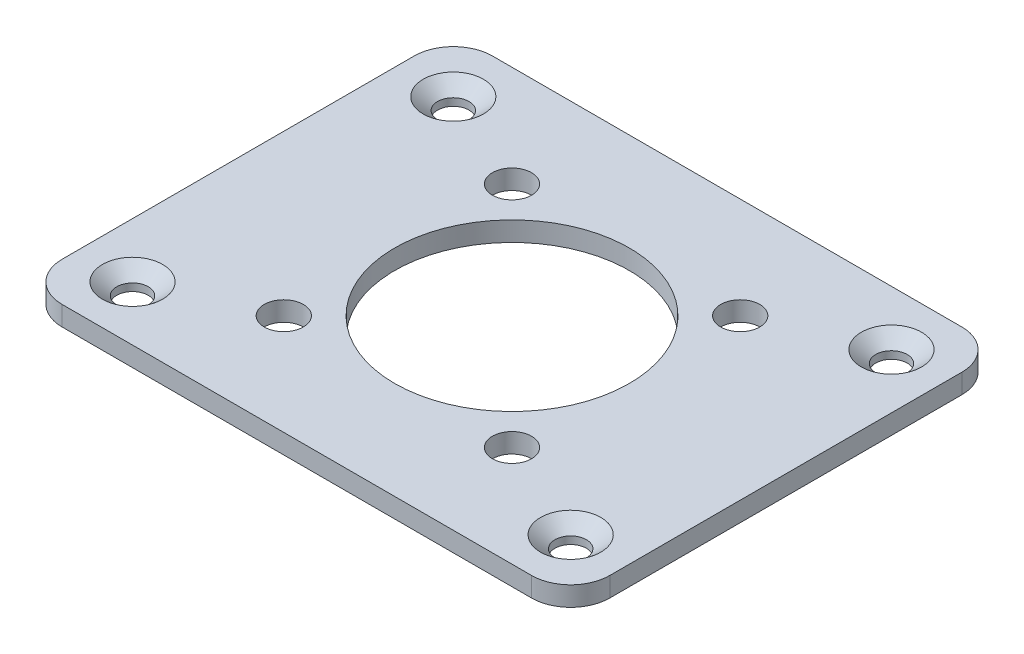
ISO-10303-21;
HEADER;
FILE_DESCRIPTION(('STEP AP214'),'2;1');
FILE_NAME('part.step','',(''),(''),'','','');
FILE_SCHEMA(('AUTOMOTIVE_DESIGN { 1 0 10303 214 1 1 1 1 }'));
ENDSEC;
DATA;
#1=APPLICATION_CONTEXT('core data for automotive mechanical design processes');
#2=APPLICATION_PROTOCOL_DEFINITION('international standard','automotive_design',2000,#1);
#3=PRODUCT_CONTEXT('',#1,'mechanical');
#4=PRODUCT('Part','Part','',(#3));
#5=PRODUCT_RELATED_PRODUCT_CATEGORY('part','',(#4));
#6=PRODUCT_DEFINITION_FORMATION('','',#4);
#7=PRODUCT_DEFINITION_CONTEXT('part definition',#1,'design');
#8=PRODUCT_DEFINITION('design','',#6,#7);
#9=PRODUCT_DEFINITION_SHAPE('','',#8);
#10=(LENGTH_UNIT() NAMED_UNIT(*) SI_UNIT(.MILLI.,.METRE.));
#11=(NAMED_UNIT(*) PLANE_ANGLE_UNIT() SI_UNIT($,.RADIAN.));
#12=(NAMED_UNIT(*) SI_UNIT($,.STERADIAN.) SOLID_ANGLE_UNIT());
#13=UNCERTAINTY_MEASURE_WITH_UNIT(LENGTH_MEASURE(1.E-05),#10,'distance_accuracy_value','');
#14=(GEOMETRIC_REPRESENTATION_CONTEXT(3) GLOBAL_UNCERTAINTY_ASSIGNED_CONTEXT((#13)) GLOBAL_UNIT_ASSIGNED_CONTEXT((#10,
#11,#12)) REPRESENTATION_CONTEXT('',''));
#15=CARTESIAN_POINT('',(0.,0.,0.));
#16=DIRECTION('',(0.,0.,1.));
#17=DIRECTION('',(1.,0.,0.));
#18=AXIS2_PLACEMENT_3D('',#15,#16,#17);
#19=CARTESIAN_POINT('',(0.,3.17499999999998,0.));
#20=DIRECTION('',(0.,1.,0.));
#21=DIRECTION('',(0.,0.,1.));
#22=AXIS2_PLACEMENT_3D('',#19,#20,#21);
#23=PLANE('',#22);
#24=CARTESIAN_POINT('',(-35.5600000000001,3.17500000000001,-26.0350000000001));
#25=DIRECTION('',(0.,1.,0.));
#26=DIRECTION('',(0.,0.,1.));
#27=AXIS2_PLACEMENT_3D('',#24,#25,#26);
#28=CIRCLE('',#27,4.8895);
#29=CARTESIAN_POINT('',(-35.5600000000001,3.17500000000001,-21.1455000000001));
#30=VERTEX_POINT('',#29);
#31=EDGE_CURVE('E259',#30,#30,#28,.T.);
#32=ORIENTED_EDGE('',*,*,#31,.F.);
#33=EDGE_LOOP('',(#32));
#34=FACE_BOUND('',#33,.T.);
#35=CARTESIAN_POINT('',(35.5600000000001,3.17500000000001,-26.0350000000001));
#36=DIRECTION('',(0.,1.,0.));
#37=DIRECTION('',(0.,0.,1.));
#38=AXIS2_PLACEMENT_3D('',#35,#36,#37);
#39=CIRCLE('',#38,4.8895);
#40=CARTESIAN_POINT('',(35.5600000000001,3.17500000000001,-21.1455000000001));
#41=VERTEX_POINT('',#40);
#42=EDGE_CURVE('E250',#41,#41,#39,.T.);
#43=ORIENTED_EDGE('',*,*,#42,.F.);
#44=EDGE_LOOP('',(#43));
#45=FACE_BOUND('',#44,.T.);
#46=CARTESIAN_POINT('',(-35.5600000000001,3.17499999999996,26.0350000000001));
#47=DIRECTION('',(0.,1.,0.));
#48=DIRECTION('',(0.,0.,1.));
#49=AXIS2_PLACEMENT_3D('',#46,#47,#48);
#50=CIRCLE('',#49,4.8895);
#51=CARTESIAN_POINT('',(-35.5600000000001,3.17499999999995,30.9245000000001));
#52=VERTEX_POINT('',#51);
#53=EDGE_CURVE('E241',#52,#52,#50,.T.);
#54=ORIENTED_EDGE('',*,*,#53,.F.);
#55=EDGE_LOOP('',(#54));
#56=FACE_BOUND('',#55,.T.);
#57=CARTESIAN_POINT('',(35.5600000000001,3.17499999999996,26.0350000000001));
#58=DIRECTION('',(0.,1.,0.));
#59=DIRECTION('',(0.,0.,1.));
#60=AXIS2_PLACEMENT_3D('',#57,#58,#59);
#61=CIRCLE('',#60,4.8895);
#62=CARTESIAN_POINT('',(35.5600000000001,3.17499999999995,30.9245000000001));
#63=VERTEX_POINT('',#62);
#64=EDGE_CURVE('E232',#63,#63,#61,.T.);
#65=ORIENTED_EDGE('',*,*,#64,.F.);
#66=EDGE_LOOP('',(#65));
#67=FACE_BOUND('',#66,.T.);
#68=CARTESIAN_POINT('',(-18.5217782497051,3.17499999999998,18.5217782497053));
#69=DIRECTION('',(0.,1.,0.));
#70=DIRECTION('',(0.,0.,1.));
#71=AXIS2_PLACEMENT_3D('',#68,#69,#70);
#72=CIRCLE('',#71,3.17499999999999);
#73=CARTESIAN_POINT('',(-18.5217782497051,3.17499999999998,21.6967782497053));
#74=VERTEX_POINT('',#73);
#75=EDGE_CURVE('E223',#74,#74,#72,.T.);
#76=ORIENTED_EDGE('',*,*,#75,.F.);
#77=EDGE_LOOP('',(#76));
#78=FACE_BOUND('',#77,.T.);
#79=CARTESIAN_POINT('',(18.5217782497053,3.17499999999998,18.5217782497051));
#80=DIRECTION('',(0.,1.,0.));
#81=DIRECTION('',(0.,0.,1.));
#82=AXIS2_PLACEMENT_3D('',#79,#80,#81);
#83=CIRCLE('',#82,3.17499999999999);
#84=CARTESIAN_POINT('',(18.5217782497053,3.17499999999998,21.6967782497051));
#85=VERTEX_POINT('',#84);
#86=EDGE_CURVE('E217',#85,#85,#83,.T.);
#87=ORIENTED_EDGE('',*,*,#86,.F.);
#88=EDGE_LOOP('',(#87));
#89=FACE_BOUND('',#88,.T.);
#90=CARTESIAN_POINT('',(18.5217782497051,3.17500000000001,-18.5217782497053));
#91=DIRECTION('',(0.,1.,0.));
#92=DIRECTION('',(0.,0.,1.));
#93=AXIS2_PLACEMENT_3D('',#90,#91,#92);
#94=CIRCLE('',#93,3.17499999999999);
#95=CARTESIAN_POINT('',(18.5217782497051,3.17500000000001,-15.3467782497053));
#96=VERTEX_POINT('',#95);
#97=EDGE_CURVE('E211',#96,#96,#94,.T.);
#98=ORIENTED_EDGE('',*,*,#97,.F.);
#99=EDGE_LOOP('',(#98));
#100=FACE_BOUND('',#99,.T.);
#101=CARTESIAN_POINT('',(-18.5217782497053,3.17500000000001,-18.5217782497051));
#102=DIRECTION('',(0.,1.,0.));
#103=DIRECTION('',(0.,0.,1.));
#104=AXIS2_PLACEMENT_3D('',#101,#102,#103);
#105=CIRCLE('',#104,3.17499999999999);
#106=CARTESIAN_POINT('',(-18.5217782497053,3.17500000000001,-15.3467782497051));
#107=VERTEX_POINT('',#106);
#108=EDGE_CURVE('E205',#107,#107,#105,.T.);
#109=ORIENTED_EDGE('',*,*,#108,.F.);
#110=EDGE_LOOP('',(#109));
#111=FACE_BOUND('',#110,.T.);
#112=DIRECTION('',(-1.,0.,0.));
#113=VECTOR('',#112,1.);
#114=CARTESIAN_POINT('',(-44.4500000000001,3.17500000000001,-34.9250000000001));
#115=LINE('',#114,#113);
#116=CARTESIAN_POINT('',(38.1,3.17500000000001,-34.9250000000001));
#117=VERTEX_POINT('',#116);
#118=CARTESIAN_POINT('',(-38.1000000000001,3.17500000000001,-34.9250000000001));
#119=VERTEX_POINT('',#118);
#120=EDGE_CURVE('E187',#117,#119,#115,.T.);
#121=ORIENTED_EDGE('',*,*,#120,.T.);
#122=CARTESIAN_POINT('',(-38.1000000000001,3.17500000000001,-28.575));
#123=DIRECTION('',(0.,1.,0.));
#124=DIRECTION('',(0.,0.,1.));
#125=AXIS2_PLACEMENT_3D('',#122,#123,#124);
#126=CIRCLE('',#125,6.35);
#127=CARTESIAN_POINT('',(-44.4500000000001,3.17500000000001,-28.575));
#128=VERTEX_POINT('',#127);
#129=EDGE_CURVE('E168',#119,#128,#126,.T.);
#130=ORIENTED_EDGE('',*,*,#129,.T.);
#131=DIRECTION('',(0.,0.,1.));
#132=VECTOR('',#131,1.);
#133=CARTESIAN_POINT('',(-44.4500000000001,3.17500000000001,-34.9250000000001));
#134=LINE('',#133,#132);
#135=CARTESIAN_POINT('',(-44.4500000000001,3.17499999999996,28.575));
#136=VERTEX_POINT('',#135);
#137=EDGE_CURVE('E138',#128,#136,#134,.T.);
#138=ORIENTED_EDGE('',*,*,#137,.T.);
#139=CARTESIAN_POINT('',(-38.1000000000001,3.17499999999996,28.575));
#140=DIRECTION('',(0.,1.,0.));
#141=DIRECTION('',(0.,0.,1.));
#142=AXIS2_PLACEMENT_3D('',#139,#140,#141);
#143=CIRCLE('',#142,6.35);
#144=CARTESIAN_POINT('',(-38.1000000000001,3.17499999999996,34.9250000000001));
#145=VERTEX_POINT('',#144);
#146=EDGE_CURVE('E74',#136,#145,#143,.T.);
#147=ORIENTED_EDGE('',*,*,#146,.T.);
#148=DIRECTION('',(1.,0.,0.));
#149=VECTOR('',#148,1.);
#150=CARTESIAN_POINT('',(-44.4500000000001,3.17499999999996,34.9250000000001));
#151=LINE('',#150,#149);
#152=CARTESIAN_POINT('',(38.1000000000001,3.17499999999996,34.9250000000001));
#153=VERTEX_POINT('',#152);
#154=EDGE_CURVE('E154',#145,#153,#151,.T.);
#155=ORIENTED_EDGE('',*,*,#154,.T.);
#156=CARTESIAN_POINT('',(38.1000000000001,3.17499999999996,28.575));
#157=DIRECTION('',(0.,1.,0.));
#158=DIRECTION('',(0.,0.,1.));
#159=AXIS2_PLACEMENT_3D('',#156,#157,#158);
#160=CIRCLE('',#159,6.35);
#161=CARTESIAN_POINT('',(44.4500000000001,3.17499999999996,28.575));
#162=VERTEX_POINT('',#161);
#163=EDGE_CURVE('E165',#153,#162,#160,.T.);
#164=ORIENTED_EDGE('',*,*,#163,.T.);
#165=DIRECTION('',(0.,0.,-1.));
#166=VECTOR('',#165,1.);
#167=CARTESIAN_POINT('',(44.45,3.17500000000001,-34.9250000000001));
#168=LINE('',#167,#166);
#169=CARTESIAN_POINT('',(44.45,3.17500000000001,-28.575));
#170=VERTEX_POINT('',#169);
#171=EDGE_CURVE('E148',#162,#170,#168,.T.);
#172=ORIENTED_EDGE('',*,*,#171,.T.);
#173=CARTESIAN_POINT('',(38.1,3.17500000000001,-28.575));
#174=DIRECTION('',(0.,1.,0.));
#175=DIRECTION('',(0.,0.,1.));
#176=AXIS2_PLACEMENT_3D('',#173,#174,#175);
#177=CIRCLE('',#176,6.35);
#178=EDGE_CURVE('E163',#170,#117,#177,.T.);
#179=ORIENTED_EDGE('',*,*,#178,.T.);
#180=EDGE_LOOP('',(#121,#130,#138,#147,#155,#164,#172,#179));
#181=FACE_BOUND('',#180,.T.);
#182=CARTESIAN_POINT('',(0.,3.17499999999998,0.));
#183=DIRECTION('',(0.,1.,0.));
#184=DIRECTION('',(0.,0.,1.));
#185=AXIS2_PLACEMENT_3D('',#182,#183,#184);
#186=CIRCLE('',#185,19.05);
#187=CARTESIAN_POINT('',(0.,3.17499999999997,19.05));
#188=VERTEX_POINT('',#187);
#189=EDGE_CURVE('E192',#188,#188,#186,.T.);
#190=ORIENTED_EDGE('',*,*,#189,.F.);
#191=EDGE_LOOP('',(#190));
#192=FACE_BOUND('',#191,.T.);
#193=ADVANCED_FACE('F52',(#34,#45,#56,#67,#78,#89,#100,#111,#181,#192),#23,.T.);
#194=CARTESIAN_POINT('',(0.,0.,0.));
#195=DIRECTION('',(0.,1.,0.));
#196=DIRECTION('',(0.,0.,1.));
#197=AXIS2_PLACEMENT_3D('',#194,#195,#196);
#198=PLANE('',#197);
#199=CARTESIAN_POINT('',(-35.5600000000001,0.,-26.0350000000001));
#200=DIRECTION('',(0.,1.,0.));
#201=DIRECTION('',(0.,0.,1.));
#202=AXIS2_PLACEMENT_3D('',#199,#200,#201);
#203=CIRCLE('',#202,2.55269999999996);
#204=CARTESIAN_POINT('',(-35.5600000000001,0.,-23.4823000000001));
#205=VERTEX_POINT('',#204);
#206=EDGE_CURVE('E253',#205,#205,#203,.T.);
#207=ORIENTED_EDGE('',*,*,#206,.T.);
#208=EDGE_LOOP('',(#207));
#209=FACE_BOUND('',#208,.T.);
#210=CARTESIAN_POINT('',(35.5600000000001,0.,-26.0350000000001));
#211=DIRECTION('',(0.,1.,0.));
#212=DIRECTION('',(0.,0.,1.));
#213=AXIS2_PLACEMENT_3D('',#210,#211,#212);
#214=CIRCLE('',#213,2.55269999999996);
#215=CARTESIAN_POINT('',(35.5600000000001,0.,-23.4823000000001));
#216=VERTEX_POINT('',#215);
#217=EDGE_CURVE('E244',#216,#216,#214,.T.);
#218=ORIENTED_EDGE('',*,*,#217,.T.);
#219=EDGE_LOOP('',(#218));
#220=FACE_BOUND('',#219,.T.);
#221=CARTESIAN_POINT('',(-35.5600000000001,0.,26.0350000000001));
#222=DIRECTION('',(0.,1.,0.));
#223=DIRECTION('',(0.,0.,1.));
#224=AXIS2_PLACEMENT_3D('',#221,#222,#223);
#225=CIRCLE('',#224,2.55269999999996);
#226=CARTESIAN_POINT('',(-35.5600000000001,0.,28.5877));
#227=VERTEX_POINT('',#226);
#228=EDGE_CURVE('E235',#227,#227,#225,.T.);
#229=ORIENTED_EDGE('',*,*,#228,.T.);
#230=EDGE_LOOP('',(#229));
#231=FACE_BOUND('',#230,.T.);
#232=CARTESIAN_POINT('',(35.5600000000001,0.,26.0350000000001));
#233=DIRECTION('',(0.,1.,0.));
#234=DIRECTION('',(0.,0.,1.));
#235=AXIS2_PLACEMENT_3D('',#232,#233,#234);
#236=CIRCLE('',#235,2.55269999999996);
#237=CARTESIAN_POINT('',(35.5600000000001,0.,28.5877));
#238=VERTEX_POINT('',#237);
#239=EDGE_CURVE('E226',#238,#238,#236,.T.);
#240=ORIENTED_EDGE('',*,*,#239,.T.);
#241=EDGE_LOOP('',(#240));
#242=FACE_BOUND('',#241,.T.);
#243=CARTESIAN_POINT('',(-18.5217782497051,0.,18.5217782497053));
#244=DIRECTION('',(0.,1.,0.));
#245=DIRECTION('',(0.,0.,1.));
#246=AXIS2_PLACEMENT_3D('',#243,#244,#245);
#247=CIRCLE('',#246,3.175);
#248=CARTESIAN_POINT('',(-18.5217782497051,0.,21.6967782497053));
#249=VERTEX_POINT('',#248);
#250=EDGE_CURVE('E220',#249,#249,#247,.T.);
#251=ORIENTED_EDGE('',*,*,#250,.T.);
#252=EDGE_LOOP('',(#251));
#253=FACE_BOUND('',#252,.T.);
#254=CARTESIAN_POINT('',(18.5217782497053,0.,18.5217782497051));
#255=DIRECTION('',(0.,1.,0.));
#256=DIRECTION('',(0.,0.,1.));
#257=AXIS2_PLACEMENT_3D('',#254,#255,#256);
#258=CIRCLE('',#257,3.175);
#259=CARTESIAN_POINT('',(18.5217782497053,0.,21.6967782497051));
#260=VERTEX_POINT('',#259);
#261=EDGE_CURVE('E214',#260,#260,#258,.T.);
#262=ORIENTED_EDGE('',*,*,#261,.T.);
#263=EDGE_LOOP('',(#262));
#264=FACE_BOUND('',#263,.T.);
#265=CARTESIAN_POINT('',(18.5217782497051,0.,-18.5217782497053));
#266=DIRECTION('',(0.,1.,0.));
#267=DIRECTION('',(0.,0.,1.));
#268=AXIS2_PLACEMENT_3D('',#265,#266,#267);
#269=CIRCLE('',#268,3.175);
#270=CARTESIAN_POINT('',(18.5217782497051,0.,-15.3467782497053));
#271=VERTEX_POINT('',#270);
#272=EDGE_CURVE('E208',#271,#271,#269,.T.);
#273=ORIENTED_EDGE('',*,*,#272,.T.);
#274=EDGE_LOOP('',(#273));
#275=FACE_BOUND('',#274,.T.);
#276=CARTESIAN_POINT('',(-18.5217782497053,0.,-18.5217782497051));
#277=DIRECTION('',(0.,1.,0.));
#278=DIRECTION('',(0.,0.,1.));
#279=AXIS2_PLACEMENT_3D('',#276,#277,#278);
#280=CIRCLE('',#279,3.175);
#281=CARTESIAN_POINT('',(-18.5217782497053,0.,-15.3467782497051));
#282=VERTEX_POINT('',#281);
#283=EDGE_CURVE('E201',#282,#282,#280,.T.);
#284=ORIENTED_EDGE('',*,*,#283,.T.);
#285=EDGE_LOOP('',(#284));
#286=FACE_BOUND('',#285,.T.);
#287=DIRECTION('',(0.,0.,1.));
#288=VECTOR('',#287,1.);
#289=CARTESIAN_POINT('',(-44.4500000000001,0.,-34.9250000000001));
#290=LINE('',#289,#288);
#291=CARTESIAN_POINT('',(-44.4500000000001,0.,-28.575));
#292=VERTEX_POINT('',#291);
#293=CARTESIAN_POINT('',(-44.4500000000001,0.,28.575));
#294=VERTEX_POINT('',#293);
#295=EDGE_CURVE('E136',#292,#294,#290,.T.);
#296=ORIENTED_EDGE('',*,*,#295,.F.);
#297=CARTESIAN_POINT('',(-38.1000000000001,0.,-28.575));
#298=DIRECTION('',(0.,1.,0.));
#299=DIRECTION('',(0.,0.,1.));
#300=AXIS2_PLACEMENT_3D('',#297,#298,#299);
#301=CIRCLE('',#300,6.35);
#302=CARTESIAN_POINT('',(-38.1000000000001,0.,-34.9250000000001));
#303=VERTEX_POINT('',#302);
#304=EDGE_CURVE('E119',#292,#303,#301,.F.);
#305=ORIENTED_EDGE('',*,*,#304,.T.);
#306=DIRECTION('',(-1.,0.,0.));
#307=VECTOR('',#306,1.);
#308=CARTESIAN_POINT('',(-44.4500000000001,0.,-34.9250000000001));
#309=LINE('',#308,#307);
#310=CARTESIAN_POINT('',(38.1,0.,-34.9250000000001));
#311=VERTEX_POINT('',#310);
#312=EDGE_CURVE('E146',#311,#303,#309,.T.);
#313=ORIENTED_EDGE('',*,*,#312,.F.);
#314=CARTESIAN_POINT('',(38.1,0.,-28.575));
#315=DIRECTION('',(0.,1.,0.));
#316=DIRECTION('',(0.,0.,1.));
#317=AXIS2_PLACEMENT_3D('',#314,#315,#316);
#318=CIRCLE('',#317,6.35);
#319=CARTESIAN_POINT('',(44.45,0.,-28.575));
#320=VERTEX_POINT('',#319);
#321=EDGE_CURVE('E139',#311,#320,#318,.F.);
#322=ORIENTED_EDGE('',*,*,#321,.T.);
#323=DIRECTION('',(0.,0.,-1.));
#324=VECTOR('',#323,1.);
#325=CARTESIAN_POINT('',(44.45,0.,-34.9250000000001));
#326=LINE('',#325,#324);
#327=CARTESIAN_POINT('',(44.4500000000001,0.,28.575));
#328=VERTEX_POINT('',#327);
#329=EDGE_CURVE('E150',#328,#320,#326,.T.);
#330=ORIENTED_EDGE('',*,*,#329,.F.);
#331=CARTESIAN_POINT('',(38.1000000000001,0.,28.575));
#332=DIRECTION('',(0.,1.,0.));
#333=DIRECTION('',(0.,0.,1.));
#334=AXIS2_PLACEMENT_3D('',#331,#332,#333);
#335=CIRCLE('',#334,6.35);
#336=CARTESIAN_POINT('',(38.1000000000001,0.,34.9250000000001));
#337=VERTEX_POINT('',#336);
#338=EDGE_CURVE('E157',#328,#337,#335,.F.);
#339=ORIENTED_EDGE('',*,*,#338,.T.);
#340=DIRECTION('',(1.,0.,0.));
#341=VECTOR('',#340,1.);
#342=CARTESIAN_POINT('',(-44.4500000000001,0.,34.9250000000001));
#343=LINE('',#342,#341);
#344=CARTESIAN_POINT('',(-38.1000000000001,0.,34.9250000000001));
#345=VERTEX_POINT('',#344);
#346=EDGE_CURVE('E145',#345,#337,#343,.T.);
#347=ORIENTED_EDGE('',*,*,#346,.F.);
#348=CARTESIAN_POINT('',(-38.1000000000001,0.,28.575));
#349=DIRECTION('',(0.,1.,0.));
#350=DIRECTION('',(0.,0.,1.));
#351=AXIS2_PLACEMENT_3D('',#348,#349,#350);
#352=CIRCLE('',#351,6.35);
#353=EDGE_CURVE('E130',#345,#294,#352,.F.);
#354=ORIENTED_EDGE('',*,*,#353,.T.);
#355=EDGE_LOOP('',(#296,#305,#313,#322,#330,#339,#347,#354));
#356=FACE_BOUND('',#355,.T.);
#357=CARTESIAN_POINT('',(0.,0.,0.));
#358=DIRECTION('',(0.,1.,0.));
#359=DIRECTION('',(0.,0.,1.));
#360=AXIS2_PLACEMENT_3D('',#357,#358,#359);
#361=CIRCLE('',#360,19.05);
#362=CARTESIAN_POINT('',(0.,0.,19.05));
#363=VERTEX_POINT('',#362);
#364=EDGE_CURVE('E194',#363,#363,#361,.T.);
#365=ORIENTED_EDGE('',*,*,#364,.T.);
#366=EDGE_LOOP('',(#365));
#367=FACE_BOUND('',#366,.T.);
#368=ADVANCED_FACE('F142',(#209,#220,#231,#242,#253,#264,#275,#286,#356,#367),#198,.F.);
#369=CARTESIAN_POINT('',(44.45,3.17500000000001,-34.9250000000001));
#370=DIRECTION('',(-1.,0.,0.));
#371=DIRECTION('',(0.,0.,1.));
#372=AXIS2_PLACEMENT_3D('',#369,#370,#371);
#373=PLANE('',#372);
#374=ORIENTED_EDGE('',*,*,#171,.F.);
#375=DIRECTION('',(0.,-1.,0.));
#376=VECTOR('',#375,1.);
#377=CARTESIAN_POINT('',(44.4500000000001,3.17499999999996,28.575));
#378=LINE('',#377,#376);
#379=EDGE_CURVE('E13',#162,#328,#378,.T.);
#380=ORIENTED_EDGE('',*,*,#379,.T.);
#381=ORIENTED_EDGE('',*,*,#329,.T.);
#382=DIRECTION('',(0.,-1.,0.));
#383=VECTOR('',#382,1.);
#384=CARTESIAN_POINT('',(44.45,3.17500000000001,-28.575));
#385=LINE('',#384,#383);
#386=EDGE_CURVE('E60',#320,#170,#385,.F.);
#387=ORIENTED_EDGE('',*,*,#386,.T.);
#388=EDGE_LOOP('',(#374,#380,#381,#387));
#389=FACE_BOUND('',#388,.T.);
#390=ADVANCED_FACE('F178',(#389),#373,.F.);
#391=CARTESIAN_POINT('',(-44.4500000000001,3.17500000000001,-34.9250000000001));
#392=DIRECTION('',(0.,0.,1.));
#393=DIRECTION('',(1.,0.,0.));
#394=AXIS2_PLACEMENT_3D('',#391,#392,#393);
#395=PLANE('',#394);
#396=ORIENTED_EDGE('',*,*,#312,.T.);
#397=DIRECTION('',(0.,-1.,0.));
#398=VECTOR('',#397,1.);
#399=CARTESIAN_POINT('',(-38.1000000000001,3.17500000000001,-34.9250000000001));
#400=LINE('',#399,#398);
#401=EDGE_CURVE('E124',#303,#119,#400,.F.);
#402=ORIENTED_EDGE('',*,*,#401,.T.);
#403=ORIENTED_EDGE('',*,*,#120,.F.);
#404=DIRECTION('',(0.,-1.,0.));
#405=VECTOR('',#404,1.);
#406=CARTESIAN_POINT('',(38.1,3.17500000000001,-34.9250000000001));
#407=LINE('',#406,#405);
#408=EDGE_CURVE('E129',#117,#311,#407,.T.);
#409=ORIENTED_EDGE('',*,*,#408,.T.);
#410=EDGE_LOOP('',(#396,#402,#403,#409));
#411=FACE_BOUND('',#410,.T.);
#412=ADVANCED_FACE('F191',(#411),#395,.F.);
#413=CARTESIAN_POINT('',(-44.4500000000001,3.17500000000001,-34.9250000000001));
#414=DIRECTION('',(1.,0.,0.));
#415=DIRECTION('',(0.,0.,-1.));
#416=AXIS2_PLACEMENT_3D('',#413,#414,#415);
#417=PLANE('',#416);
#418=ORIENTED_EDGE('',*,*,#137,.F.);
#419=DIRECTION('',(0.,-1.,0.));
#420=VECTOR('',#419,1.);
#421=CARTESIAN_POINT('',(-44.4500000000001,3.17500000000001,-28.575));
#422=LINE('',#421,#420);
#423=EDGE_CURVE('E123',#128,#292,#422,.T.);
#424=ORIENTED_EDGE('',*,*,#423,.T.);
#425=ORIENTED_EDGE('',*,*,#295,.T.);
#426=DIRECTION('',(0.,-1.,0.));
#427=VECTOR('',#426,1.);
#428=CARTESIAN_POINT('',(-44.4500000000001,3.17499999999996,28.575));
#429=LINE('',#428,#427);
#430=EDGE_CURVE('E140',#294,#136,#429,.F.);
#431=ORIENTED_EDGE('',*,*,#430,.T.);
#432=EDGE_LOOP('',(#418,#424,#425,#431));
#433=FACE_BOUND('',#432,.T.);
#434=ADVANCED_FACE('F135',(#433),#417,.F.);
#435=CARTESIAN_POINT('',(-44.4500000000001,3.17499999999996,34.9250000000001));
#436=DIRECTION('',(0.,0.,-1.));
#437=DIRECTION('',(-1.,0.,0.));
#438=AXIS2_PLACEMENT_3D('',#435,#436,#437);
#439=PLANE('',#438);
#440=ORIENTED_EDGE('',*,*,#154,.F.);
#441=DIRECTION('',(0.,-1.,0.));
#442=VECTOR('',#441,1.);
#443=CARTESIAN_POINT('',(-38.1000000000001,3.17499999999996,34.9250000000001));
#444=LINE('',#443,#442);
#445=EDGE_CURVE('E171',#145,#345,#444,.T.);
#446=ORIENTED_EDGE('',*,*,#445,.T.);
#447=ORIENTED_EDGE('',*,*,#346,.T.);
#448=DIRECTION('',(0.,-1.,0.));
#449=VECTOR('',#448,1.);
#450=CARTESIAN_POINT('',(38.1000000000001,3.17499999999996,34.9250000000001));
#451=LINE('',#450,#449);
#452=EDGE_CURVE('E67',#337,#153,#451,.F.);
#453=ORIENTED_EDGE('',*,*,#452,.T.);
#454=EDGE_LOOP('',(#440,#446,#447,#453));
#455=FACE_BOUND('',#454,.T.);
#456=ADVANCED_FACE('F300',(#455),#439,.F.);
#457=CARTESIAN_POINT('',(0.,3.17499999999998,0.));
#458=DIRECTION('',(0.,-1.,0.));
#459=DIRECTION('',(0.,0.,-1.));
#460=AXIS2_PLACEMENT_3D('',#457,#458,#459);
#461=CYLINDRICAL_SURFACE('',#460,19.05);
#462=ORIENTED_EDGE('',*,*,#189,.T.);
#463=EDGE_LOOP('',(#462));
#464=FACE_BOUND('',#463,.T.);
#465=ORIENTED_EDGE('',*,*,#364,.F.);
#466=EDGE_LOOP('',(#465));
#467=FACE_BOUND('',#466,.T.);
#468=ADVANCED_FACE('F298',(#464,#467),#461,.F.);
#469=CARTESIAN_POINT('',(-38.1000000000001,3.17500000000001,-28.575));
#470=DIRECTION('',(0.,-1.,0.));
#471=DIRECTION('',(0.,0.,-1.));
#472=AXIS2_PLACEMENT_3D('',#469,#470,#471);
#473=CYLINDRICAL_SURFACE('',#472,6.35);
#474=ORIENTED_EDGE('',*,*,#129,.F.);
#475=ORIENTED_EDGE('',*,*,#401,.F.);
#476=ORIENTED_EDGE('',*,*,#304,.F.);
#477=ORIENTED_EDGE('',*,*,#423,.F.);
#478=EDGE_LOOP('',(#474,#475,#476,#477));
#479=FACE_BOUND('',#478,.T.);
#480=ADVANCED_FACE('F122',(#479),#473,.T.);
#481=CARTESIAN_POINT('',(-38.1000000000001,3.17499999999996,28.575));
#482=DIRECTION('',(0.,-1.,0.));
#483=DIRECTION('',(0.,0.,-1.));
#484=AXIS2_PLACEMENT_3D('',#481,#482,#483);
#485=CYLINDRICAL_SURFACE('',#484,6.35);
#486=ORIENTED_EDGE('',*,*,#146,.F.);
#487=ORIENTED_EDGE('',*,*,#430,.F.);
#488=ORIENTED_EDGE('',*,*,#353,.F.);
#489=ORIENTED_EDGE('',*,*,#445,.F.);
#490=EDGE_LOOP('',(#486,#487,#488,#489));
#491=FACE_BOUND('',#490,.T.);
#492=ADVANCED_FACE('F316',(#491),#485,.T.);
#493=CARTESIAN_POINT('',(38.1000000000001,3.17499999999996,28.575));
#494=DIRECTION('',(0.,-1.,0.));
#495=DIRECTION('',(0.,0.,-1.));
#496=AXIS2_PLACEMENT_3D('',#493,#494,#495);
#497=CYLINDRICAL_SURFACE('',#496,6.35);
#498=ORIENTED_EDGE('',*,*,#163,.F.);
#499=ORIENTED_EDGE('',*,*,#452,.F.);
#500=ORIENTED_EDGE('',*,*,#338,.F.);
#501=ORIENTED_EDGE('',*,*,#379,.F.);
#502=EDGE_LOOP('',(#498,#499,#500,#501));
#503=FACE_BOUND('',#502,.T.);
#504=ADVANCED_FACE('F294',(#503),#497,.T.);
#505=CARTESIAN_POINT('',(38.1,3.17500000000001,-28.575));
#506=DIRECTION('',(0.,-1.,0.));
#507=DIRECTION('',(0.,0.,-1.));
#508=AXIS2_PLACEMENT_3D('',#505,#506,#507);
#509=CYLINDRICAL_SURFACE('',#508,6.35);
#510=ORIENTED_EDGE('',*,*,#178,.F.);
#511=ORIENTED_EDGE('',*,*,#386,.F.);
#512=ORIENTED_EDGE('',*,*,#321,.F.);
#513=ORIENTED_EDGE('',*,*,#408,.F.);
#514=EDGE_LOOP('',(#510,#511,#512,#513));
#515=FACE_BOUND('',#514,.T.);
#516=ADVANCED_FACE('F54',(#515),#509,.T.);
#517=CARTESIAN_POINT('',(-18.5217782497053,3.17500000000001,-18.5217782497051));
#518=DIRECTION('',(0.,1.,0.));
#519=DIRECTION('',(0.,0.,1.));
#520=AXIS2_PLACEMENT_3D('',#517,#518,#519);
#521=CYLINDRICAL_SURFACE('',#520,3.17499999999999);
#522=ORIENTED_EDGE('',*,*,#283,.F.);
#523=EDGE_LOOP('',(#522));
#524=FACE_BOUND('',#523,.T.);
#525=ORIENTED_EDGE('',*,*,#108,.T.);
#526=EDGE_LOOP('',(#525));
#527=FACE_BOUND('',#526,.T.);
#528=ADVANCED_FACE('F282',(#524,#527),#521,.F.);
#529=CARTESIAN_POINT('',(18.5217782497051,3.17500000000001,-18.5217782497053));
#530=DIRECTION('',(0.,1.,0.));
#531=DIRECTION('',(0.,0.,1.));
#532=AXIS2_PLACEMENT_3D('',#529,#530,#531);
#533=CYLINDRICAL_SURFACE('',#532,3.17499999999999);
#534=ORIENTED_EDGE('',*,*,#272,.F.);
#535=EDGE_LOOP('',(#534));
#536=FACE_BOUND('',#535,.T.);
#537=ORIENTED_EDGE('',*,*,#97,.T.);
#538=EDGE_LOOP('',(#537));
#539=FACE_BOUND('',#538,.T.);
#540=ADVANCED_FACE('F284',(#536,#539),#533,.F.);
#541=CARTESIAN_POINT('',(18.5217782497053,3.17499999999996,18.5217782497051));
#542=DIRECTION('',(0.,1.,0.));
#543=DIRECTION('',(0.,0.,1.));
#544=AXIS2_PLACEMENT_3D('',#541,#542,#543);
#545=CYLINDRICAL_SURFACE('',#544,3.17499999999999);
#546=ORIENTED_EDGE('',*,*,#261,.F.);
#547=EDGE_LOOP('',(#546));
#548=FACE_BOUND('',#547,.T.);
#549=ORIENTED_EDGE('',*,*,#86,.T.);
#550=EDGE_LOOP('',(#549));
#551=FACE_BOUND('',#550,.T.);
#552=ADVANCED_FACE('F291',(#548,#551),#545,.F.);
#553=CARTESIAN_POINT('',(-18.5217782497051,3.17499999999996,18.5217782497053));
#554=DIRECTION('',(0.,1.,0.));
#555=DIRECTION('',(0.,0.,1.));
#556=AXIS2_PLACEMENT_3D('',#553,#554,#555);
#557=CYLINDRICAL_SURFACE('',#556,3.17499999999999);
#558=ORIENTED_EDGE('',*,*,#250,.F.);
#559=EDGE_LOOP('',(#558));
#560=FACE_BOUND('',#559,.T.);
#561=ORIENTED_EDGE('',*,*,#75,.T.);
#562=EDGE_LOOP('',(#561));
#563=FACE_BOUND('',#562,.T.);
#564=ADVANCED_FACE('F348',(#560,#563),#557,.F.);
#565=CARTESIAN_POINT('',(35.5600000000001,3.17499999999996,26.0350000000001));
#566=DIRECTION('',(0.,1.,0.));
#567=DIRECTION('',(0.,0.,1.));
#568=AXIS2_PLACEMENT_3D('',#565,#566,#567);
#569=CYLINDRICAL_SURFACE('',#568,2.55269999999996);
#570=ORIENTED_EDGE('',*,*,#239,.F.);
#571=EDGE_LOOP('',(#570));
#572=FACE_BOUND('',#571,.T.);
#573=CARTESIAN_POINT('',(35.5600000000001,1.21419198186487,26.0350000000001));
#574=DIRECTION('',(0.,1.,0.));
#575=DIRECTION('',(0.,0.,1.));
#576=AXIS2_PLACEMENT_3D('',#573,#574,#575);
#577=CIRCLE('',#576,2.55269999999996);
#578=CARTESIAN_POINT('',(35.5600000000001,1.21419198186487,28.5877));
#579=VERTEX_POINT('',#578);
#580=EDGE_CURVE('E229',#579,#579,#577,.T.);
#581=ORIENTED_EDGE('',*,*,#580,.T.);
#582=EDGE_LOOP('',(#581));
#583=FACE_BOUND('',#582,.T.);
#584=ADVANCED_FACE('F357',(#572,#583),#569,.F.);
#585=CARTESIAN_POINT('',(35.5600000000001,3.17499999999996,26.0350000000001));
#586=DIRECTION('',(0.,1.,0.));
#587=DIRECTION('',(0.,0.,1.));
#588=AXIS2_PLACEMENT_3D('',#585,#586,#587);
#589=CONICAL_SURFACE('',#588,4.8895,0.872664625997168);
#590=ORIENTED_EDGE('',*,*,#580,.F.);
#591=EDGE_LOOP('',(#590));
#592=FACE_BOUND('',#591,.T.);
#593=ORIENTED_EDGE('',*,*,#64,.T.);
#594=EDGE_LOOP('',(#593));
#595=FACE_BOUND('',#594,.T.);
#596=ADVANCED_FACE('F367',(#592,#595),#589,.F.);
#597=CARTESIAN_POINT('',(-35.5600000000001,3.17499999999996,26.0350000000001));
#598=DIRECTION('',(0.,1.,0.));
#599=DIRECTION('',(0.,0.,1.));
#600=AXIS2_PLACEMENT_3D('',#597,#598,#599);
#601=CYLINDRICAL_SURFACE('',#600,2.55269999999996);
#602=ORIENTED_EDGE('',*,*,#228,.F.);
#603=EDGE_LOOP('',(#602));
#604=FACE_BOUND('',#603,.T.);
#605=CARTESIAN_POINT('',(-35.5600000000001,1.21419198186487,26.0350000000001));
#606=DIRECTION('',(0.,1.,0.));
#607=DIRECTION('',(0.,0.,1.));
#608=AXIS2_PLACEMENT_3D('',#605,#606,#607);
#609=CIRCLE('',#608,2.55269999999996);
#610=CARTESIAN_POINT('',(-35.5600000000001,1.21419198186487,28.5877));
#611=VERTEX_POINT('',#610);
#612=EDGE_CURVE('E238',#611,#611,#609,.T.);
#613=ORIENTED_EDGE('',*,*,#612,.T.);
#614=EDGE_LOOP('',(#613));
#615=FACE_BOUND('',#614,.T.);
#616=ADVANCED_FACE('F377',(#604,#615),#601,.F.);
#617=CARTESIAN_POINT('',(-35.5600000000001,3.17499999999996,26.0350000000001));
#618=DIRECTION('',(0.,1.,0.));
#619=DIRECTION('',(0.,0.,1.));
#620=AXIS2_PLACEMENT_3D('',#617,#618,#619);
#621=CONICAL_SURFACE('',#620,4.8895,0.872664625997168);
#622=ORIENTED_EDGE('',*,*,#612,.F.);
#623=EDGE_LOOP('',(#622));
#624=FACE_BOUND('',#623,.T.);
#625=ORIENTED_EDGE('',*,*,#53,.T.);
#626=EDGE_LOOP('',(#625));
#627=FACE_BOUND('',#626,.T.);
#628=ADVANCED_FACE('F387',(#624,#627),#621,.F.);
#629=CARTESIAN_POINT('',(35.5600000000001,3.17500000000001,-26.0350000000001));
#630=DIRECTION('',(0.,1.,0.));
#631=DIRECTION('',(0.,0.,1.));
#632=AXIS2_PLACEMENT_3D('',#629,#630,#631);
#633=CYLINDRICAL_SURFACE('',#632,2.55269999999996);
#634=ORIENTED_EDGE('',*,*,#217,.F.);
#635=EDGE_LOOP('',(#634));
#636=FACE_BOUND('',#635,.T.);
#637=CARTESIAN_POINT('',(35.5600000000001,1.21419198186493,-26.0350000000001));
#638=DIRECTION('',(0.,1.,0.));
#639=DIRECTION('',(0.,0.,1.));
#640=AXIS2_PLACEMENT_3D('',#637,#638,#639);
#641=CIRCLE('',#640,2.55269999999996);
#642=CARTESIAN_POINT('',(35.5600000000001,1.21419198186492,-23.4823000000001));
#643=VERTEX_POINT('',#642);
#644=EDGE_CURVE('E247',#643,#643,#641,.T.);
#645=ORIENTED_EDGE('',*,*,#644,.T.);
#646=EDGE_LOOP('',(#645));
#647=FACE_BOUND('',#646,.T.);
#648=ADVANCED_FACE('F397',(#636,#647),#633,.F.);
#649=CARTESIAN_POINT('',(35.5600000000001,3.17500000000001,-26.0350000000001));
#650=DIRECTION('',(0.,1.,0.));
#651=DIRECTION('',(0.,0.,1.));
#652=AXIS2_PLACEMENT_3D('',#649,#650,#651);
#653=CONICAL_SURFACE('',#652,4.8895,0.872664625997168);
#654=ORIENTED_EDGE('',*,*,#644,.F.);
#655=EDGE_LOOP('',(#654));
#656=FACE_BOUND('',#655,.T.);
#657=ORIENTED_EDGE('',*,*,#42,.T.);
#658=EDGE_LOOP('',(#657));
#659=FACE_BOUND('',#658,.T.);
#660=ADVANCED_FACE('F407',(#656,#659),#653,.F.);
#661=CARTESIAN_POINT('',(-35.5600000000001,3.17500000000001,-26.0350000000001));
#662=DIRECTION('',(0.,1.,0.));
#663=DIRECTION('',(0.,0.,1.));
#664=AXIS2_PLACEMENT_3D('',#661,#662,#663);
#665=CYLINDRICAL_SURFACE('',#664,2.55269999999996);
#666=ORIENTED_EDGE('',*,*,#206,.F.);
#667=EDGE_LOOP('',(#666));
#668=FACE_BOUND('',#667,.T.);
#669=CARTESIAN_POINT('',(-35.5600000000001,1.21419198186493,-26.0350000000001));
#670=DIRECTION('',(0.,1.,0.));
#671=DIRECTION('',(0.,0.,1.));
#672=AXIS2_PLACEMENT_3D('',#669,#670,#671);
#673=CIRCLE('',#672,2.55269999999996);
#674=CARTESIAN_POINT('',(-35.5600000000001,1.21419198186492,-23.4823000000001));
#675=VERTEX_POINT('',#674);
#676=EDGE_CURVE('E256',#675,#675,#673,.T.);
#677=ORIENTED_EDGE('',*,*,#676,.T.);
#678=EDGE_LOOP('',(#677));
#679=FACE_BOUND('',#678,.T.);
#680=ADVANCED_FACE('F417',(#668,#679),#665,.F.);
#681=CARTESIAN_POINT('',(-35.5600000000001,3.17500000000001,-26.0350000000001));
#682=DIRECTION('',(0.,1.,0.));
#683=DIRECTION('',(0.,0.,1.));
#684=AXIS2_PLACEMENT_3D('',#681,#682,#683);
#685=CONICAL_SURFACE('',#684,4.8895,0.872664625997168);
#686=ORIENTED_EDGE('',*,*,#676,.F.);
#687=EDGE_LOOP('',(#686));
#688=FACE_BOUND('',#687,.T.);
#689=ORIENTED_EDGE('',*,*,#31,.T.);
#690=EDGE_LOOP('',(#689));
#691=FACE_BOUND('',#690,.T.);
#692=ADVANCED_FACE('F263',(#688,#691),#685,.F.);
#693=CLOSED_SHELL('',(#193,#368,#390,#412,#434,#456,#468,#480,#492,#504,#516,#528,#540,#552,
#564,#584,#596,#616,#628,#648,#660,#680,#692));
#694=MANIFOLD_SOLID_BREP('B2',#693);
#695=ADVANCED_BREP_SHAPE_REPRESENTATION('',(#18,#694),#14);
#696=SHAPE_DEFINITION_REPRESENTATION(#9,#695);
ENDSEC;
END-ISO-10303-21;
